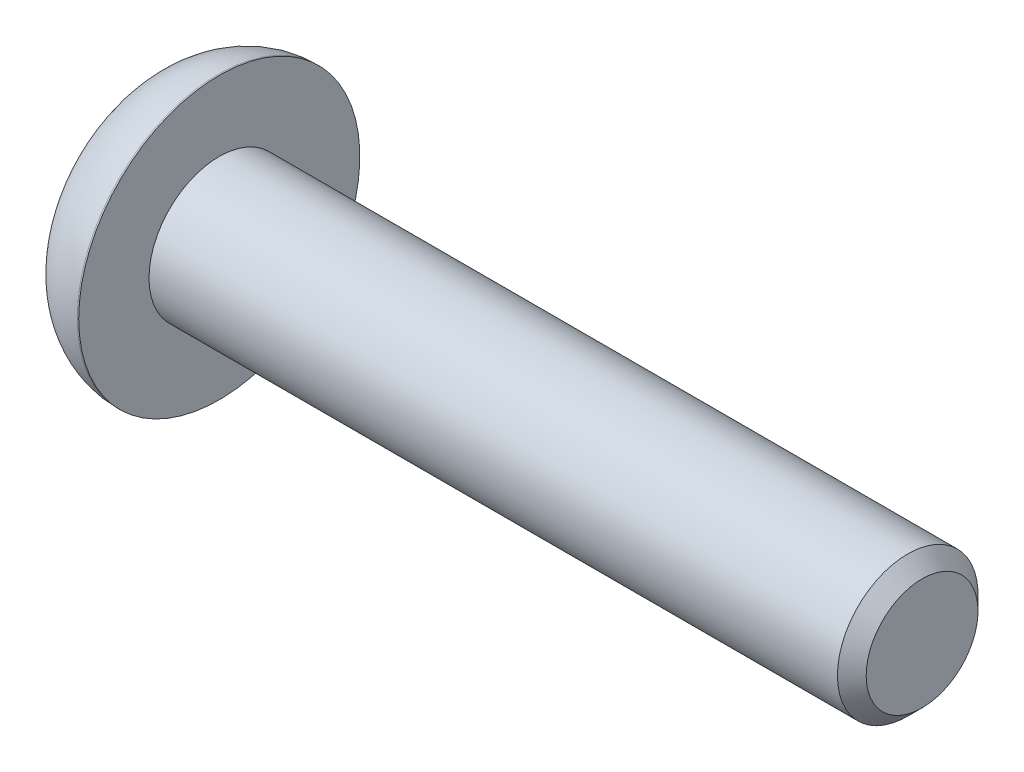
ISO-10303-21;
HEADER;
FILE_DESCRIPTION(('STEP AP214'),'2;1');
FILE_NAME('part.step','',(''),(''),'','','');
FILE_SCHEMA(('AUTOMOTIVE_DESIGN { 1 0 10303 214 1 1 1 1 }'));
ENDSEC;
DATA;
#1=APPLICATION_CONTEXT('core data for automotive mechanical design processes');
#2=APPLICATION_PROTOCOL_DEFINITION('international standard','automotive_design',2000,#1);
#3=PRODUCT_CONTEXT('',#1,'mechanical');
#4=PRODUCT('Part','Part','',(#3));
#5=PRODUCT_RELATED_PRODUCT_CATEGORY('part','',(#4));
#6=PRODUCT_DEFINITION_FORMATION('','',#4);
#7=PRODUCT_DEFINITION_CONTEXT('part definition',#1,'design');
#8=PRODUCT_DEFINITION('design','',#6,#7);
#9=PRODUCT_DEFINITION_SHAPE('','',#8);
#10=(LENGTH_UNIT() NAMED_UNIT(*) SI_UNIT(.MILLI.,.METRE.));
#11=(NAMED_UNIT(*) PLANE_ANGLE_UNIT() SI_UNIT($,.RADIAN.));
#12=(NAMED_UNIT(*) SI_UNIT($,.STERADIAN.) SOLID_ANGLE_UNIT());
#13=UNCERTAINTY_MEASURE_WITH_UNIT(LENGTH_MEASURE(1.E-05),#10,'distance_accuracy_value','');
#14=(GEOMETRIC_REPRESENTATION_CONTEXT(3) GLOBAL_UNCERTAINTY_ASSIGNED_CONTEXT((#13)) GLOBAL_UNIT_ASSIGNED_CONTEXT((#10,
#11,#12)) REPRESENTATION_CONTEXT('',''));
#15=CARTESIAN_POINT('',(0.,0.,0.));
#16=DIRECTION('',(0.,0.,1.));
#17=DIRECTION('',(1.,0.,0.));
#18=AXIS2_PLACEMENT_3D('',#15,#16,#17);
#19=CARTESIAN_POINT('',(2.14499999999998,0.,0.));
#20=DIRECTION('',(1.,0.,0.));
#21=DIRECTION('',(0.,0.,-1.));
#22=AXIS2_PLACEMENT_3D('',#19,#20,#21);
#23=PLANE('',#22);
#24=DIRECTION('',(0.,1.,0.));
#25=VECTOR('',#24,1.);
#26=CARTESIAN_POINT('',(2.14499999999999,0.,1.99999999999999));
#27=LINE('',#26,#25);
#28=CARTESIAN_POINT('',(2.14500000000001,1.15470053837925,2.));
#29=VERTEX_POINT('',#28);
#30=CARTESIAN_POINT('',(2.14499999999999,0.,1.99999999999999));
#31=VERTEX_POINT('',#30);
#32=EDGE_CURVE('E90',#29,#31,#27,.F.);
#33=ORIENTED_EDGE('',*,*,#32,.F.);
#34=DIRECTION('',(0.,-0.5,0.866025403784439));
#35=VECTOR('',#34,1.);
#36=CARTESIAN_POINT('',(2.14500000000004,1.73205080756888,0.999999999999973));
#37=LINE('',#36,#35);
#38=CARTESIAN_POINT('',(2.14500000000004,1.73205080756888,0.999999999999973));
#39=VERTEX_POINT('',#38);
#40=EDGE_CURVE('E104',#39,#29,#37,.T.);
#41=ORIENTED_EDGE('',*,*,#40,.F.);
#42=CARTESIAN_POINT('',(2.14499999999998,0.,0.));
#43=DIRECTION('',(-1.,0.,0.));
#44=DIRECTION('',(0.,0.,1.));
#45=AXIS2_PLACEMENT_3D('',#42,#43,#44);
#46=CIRCLE('',#45,2.);
#47=EDGE_CURVE('E112',#39,#31,#46,.F.);
#48=ORIENTED_EDGE('',*,*,#47,.T.);
#49=EDGE_LOOP('',(#33,#41,#48));
#50=FACE_BOUND('',#49,.T.);
#51=ADVANCED_FACE('F17',(#50),#23,.F.);
#52=CARTESIAN_POINT('',(2.14499999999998,0.,0.));
#53=DIRECTION('',(1.,0.,0.));
#54=DIRECTION('',(0.,0.,-1.));
#55=AXIS2_PLACEMENT_3D('',#52,#53,#54);
#56=PLANE('',#55);
#57=DIRECTION('',(0.,1.,0.));
#58=VECTOR('',#57,1.);
#59=CARTESIAN_POINT('',(2.14499999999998,0.,-2.));
#60=LINE('',#59,#58);
#61=CARTESIAN_POINT('',(2.14499999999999,-1.15470053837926,-1.99999999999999));
#62=VERTEX_POINT('',#61);
#63=CARTESIAN_POINT('',(2.14499999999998,0.,-2.));
#64=VERTEX_POINT('',#63);
#65=EDGE_CURVE('E153',#62,#64,#60,.T.);
#66=ORIENTED_EDGE('',*,*,#65,.F.);
#67=DIRECTION('',(0.,0.5,-0.866025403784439));
#68=VECTOR('',#67,1.);
#69=CARTESIAN_POINT('',(2.14500000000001,-1.73205080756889,-0.999999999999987));
#70=LINE('',#69,#68);
#71=CARTESIAN_POINT('',(2.14500000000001,-1.73205080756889,-0.999999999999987));
#72=VERTEX_POINT('',#71);
#73=EDGE_CURVE('E103',#72,#62,#70,.T.);
#74=ORIENTED_EDGE('',*,*,#73,.F.);
#75=CARTESIAN_POINT('',(2.14499999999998,0.,0.));
#76=DIRECTION('',(-1.,0.,0.));
#77=DIRECTION('',(0.,0.,1.));
#78=AXIS2_PLACEMENT_3D('',#75,#76,#77);
#79=CIRCLE('',#78,2.);
#80=EDGE_CURVE('E197',#72,#64,#79,.F.);
#81=ORIENTED_EDGE('',*,*,#80,.T.);
#82=EDGE_LOOP('',(#66,#74,#81));
#83=FACE_BOUND('',#82,.T.);
#84=ADVANCED_FACE('F361',(#83),#56,.F.);
#85=CARTESIAN_POINT('',(2.14499999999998,0.,0.));
#86=DIRECTION('',(1.,0.,0.));
#87=DIRECTION('',(0.,0.,-1.));
#88=AXIS2_PLACEMENT_3D('',#85,#86,#87);
#89=PLANE('',#88);
#90=DIRECTION('',(0.,0.5,0.866025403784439));
#91=VECTOR('',#90,1.);
#92=CARTESIAN_POINT('',(2.14499999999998,1.15470053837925,-2.));
#93=LINE('',#92,#91);
#94=CARTESIAN_POINT('',(2.14499999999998,1.15470053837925,-2.));
#95=VERTEX_POINT('',#94);
#96=CARTESIAN_POINT('',(2.14500000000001,1.73205080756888,-1.00000000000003));
#97=VERTEX_POINT('',#96);
#98=EDGE_CURVE('E147',#95,#97,#93,.T.);
#99=ORIENTED_EDGE('',*,*,#98,.F.);
#100=DIRECTION('',(0.,1.,0.));
#101=VECTOR('',#100,1.);
#102=CARTESIAN_POINT('',(2.14499999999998,0.,-2.));
#103=LINE('',#102,#101);
#104=EDGE_CURVE('E149',#64,#95,#103,.T.);
#105=ORIENTED_EDGE('',*,*,#104,.F.);
#106=CARTESIAN_POINT('',(2.14499999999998,0.,0.));
#107=DIRECTION('',(-1.,0.,0.));
#108=DIRECTION('',(0.,0.,1.));
#109=AXIS2_PLACEMENT_3D('',#106,#107,#108);
#110=CIRCLE('',#109,2.);
#111=EDGE_CURVE('E192',#64,#97,#110,.F.);
#112=ORIENTED_EDGE('',*,*,#111,.T.);
#113=EDGE_LOOP('',(#99,#105,#112));
#114=FACE_BOUND('',#113,.T.);
#115=ADVANCED_FACE('F346',(#114),#89,.F.);
#116=CARTESIAN_POINT('',(1.07264973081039,0.,0.));
#117=DIRECTION('',(-1.,0.,0.));
#118=DIRECTION('',(0.,0.,1.));
#119=AXIS2_PLACEMENT_3D('',#116,#117,#118);
#120=CYLINDRICAL_SURFACE('',#119,2.);
#121=CARTESIAN_POINT('',(2.14499999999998,0.,0.));
#122=DIRECTION('',(-1.,0.,0.));
#123=DIRECTION('',(0.,0.,1.));
#124=AXIS2_PLACEMENT_3D('',#121,#122,#123);
#125=CIRCLE('',#124,2.);
#126=CARTESIAN_POINT('',(2.14499999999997,-1.73205080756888,1.));
#127=VERTEX_POINT('',#126);
#128=CARTESIAN_POINT('',(2.14514973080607,-1.99999999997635,0.));
#129=VERTEX_POINT('',#128);
#130=EDGE_CURVE('E114',#127,#129,#125,.F.);
#131=ORIENTED_EDGE('',*,*,#130,.F.);
#132=CARTESIAN_POINT('',(2.14499999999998,0.,0.));
#133=DIRECTION('',(-1.,0.,0.));
#134=DIRECTION('',(0.,0.,1.));
#135=AXIS2_PLACEMENT_3D('',#132,#133,#134);
#136=CIRCLE('',#135,2.);
#137=EDGE_CURVE('E109',#127,#31,#136,.T.);
#138=ORIENTED_EDGE('',*,*,#137,.T.);
#139=ORIENTED_EDGE('',*,*,#47,.F.);
#140=CARTESIAN_POINT('',(2.14499999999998,0.,0.));
#141=DIRECTION('',(-1.,0.,0.));
#142=DIRECTION('',(0.,0.,1.));
#143=AXIS2_PLACEMENT_3D('',#140,#141,#142);
#144=CIRCLE('',#143,2.);
#145=CARTESIAN_POINT('',(2.14514973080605,1.99999999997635,0.));
#146=VERTEX_POINT('',#145);
#147=EDGE_CURVE('E120',#146,#39,#144,.F.);
#148=ORIENTED_EDGE('',*,*,#147,.F.);
#149=CARTESIAN_POINT('',(2.14529946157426,0.,0.));
#150=DIRECTION('',(-1.,0.,0.));
#151=DIRECTION('',(0.,1.,0.));
#152=AXIS2_PLACEMENT_3D('',#149,#150,#151);
#153=CIRCLE('',#152,2.00000000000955);
#154=EDGE_CURVE('E144',#146,#129,#153,.F.);
#155=ORIENTED_EDGE('',*,*,#154,.T.);
#156=EDGE_LOOP('',(#131,#138,#139,#148,#155));
#157=FACE_BOUND('',#156,.T.);
#158=ADVANCED_FACE('F110',(#157),#120,.F.);
#159=CARTESIAN_POINT('',(1.07264973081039,0.,0.));
#160=DIRECTION('',(-1.,0.,0.));
#161=DIRECTION('',(0.,0.,1.));
#162=AXIS2_PLACEMENT_3D('',#159,#160,#161);
#163=CYLINDRICAL_SURFACE('',#162,2.);
#164=ORIENTED_EDGE('',*,*,#111,.F.);
#165=ORIENTED_EDGE('',*,*,#80,.F.);
#166=CARTESIAN_POINT('',(2.14499999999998,0.,0.));
#167=DIRECTION('',(-1.,0.,0.));
#168=DIRECTION('',(0.,0.,1.));
#169=AXIS2_PLACEMENT_3D('',#166,#167,#168);
#170=CIRCLE('',#169,2.);
#171=EDGE_CURVE('E200',#129,#72,#170,.F.);
#172=ORIENTED_EDGE('',*,*,#171,.F.);
#173=CARTESIAN_POINT('',(2.14529946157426,0.,0.));
#174=DIRECTION('',(-1.,0.,0.));
#175=DIRECTION('',(0.,1.,0.));
#176=AXIS2_PLACEMENT_3D('',#173,#174,#175);
#177=CIRCLE('',#176,2.00000000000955);
#178=EDGE_CURVE('E118',#129,#146,#177,.F.);
#179=ORIENTED_EDGE('',*,*,#178,.T.);
#180=CARTESIAN_POINT('',(2.14499999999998,0.,0.));
#181=DIRECTION('',(-1.,0.,0.));
#182=DIRECTION('',(0.,0.,1.));
#183=AXIS2_PLACEMENT_3D('',#180,#181,#182);
#184=CIRCLE('',#183,2.);
#185=EDGE_CURVE('E146',#97,#146,#184,.F.);
#186=ORIENTED_EDGE('',*,*,#185,.F.);
#187=EDGE_LOOP('',(#164,#165,#172,#179,#186));
#188=FACE_BOUND('',#187,.T.);
#189=ADVANCED_FACE('F351',(#188),#163,.F.);
#190=CARTESIAN_POINT('',(2.14529946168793,0.,0.));
#191=DIRECTION('',(-1.,0.,0.));
#192=DIRECTION('',(0.,0.,1.));
#193=AXIS2_PLACEMENT_3D('',#190,#191,#192);
#194=CONICAL_SURFACE('',#193,1.99999999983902,1.04719755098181);
#195=CARTESIAN_POINT('',(3.29999999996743,3.97903932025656E-10,0.));
#196=VERTEX_POINT('',#195);
#197=VERTEX_LOOP('',#196);
#198=FACE_BOUND('',#197,.T.);
#199=ORIENTED_EDGE('',*,*,#154,.F.);
#200=ORIENTED_EDGE('',*,*,#178,.F.);
#201=EDGE_LOOP('',(#199,#200));
#202=FACE_BOUND('',#201,.T.);
#203=ADVANCED_FACE('F355',(#198,#202),#194,.F.);
#204=CARTESIAN_POINT('',(2.14499999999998,0.,0.));
#205=DIRECTION('',(1.,0.,0.));
#206=DIRECTION('',(0.,0.,-1.));
#207=AXIS2_PLACEMENT_3D('',#204,#205,#206);
#208=PLANE('',#207);
#209=DIRECTION('',(0.,-0.5,-0.866025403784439));
#210=VECTOR('',#209,1.);
#211=CARTESIAN_POINT('',(2.14499999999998,-2.3094010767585,0.));
#212=LINE('',#211,#210);
#213=CARTESIAN_POINT('',(2.145,-1.15470053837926,2.));
#214=VERTEX_POINT('',#213);
#215=EDGE_CURVE('E123',#127,#214,#212,.F.);
#216=ORIENTED_EDGE('',*,*,#215,.T.);
#217=DIRECTION('',(0.,1.,0.));
#218=VECTOR('',#217,1.);
#219=CARTESIAN_POINT('',(2.145,-1.15470053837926,2.));
#220=LINE('',#219,#218);
#221=EDGE_CURVE('E95',#214,#31,#220,.T.);
#222=ORIENTED_EDGE('',*,*,#221,.T.);
#223=ORIENTED_EDGE('',*,*,#137,.F.);
#224=EDGE_LOOP('',(#216,#222,#223));
#225=FACE_BOUND('',#224,.T.);
#226=ADVANCED_FACE('F122',(#225),#208,.F.);
#227=CARTESIAN_POINT('',(2.14499999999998,0.,0.));
#228=DIRECTION('',(1.,0.,0.));
#229=DIRECTION('',(0.,0.,-1.));
#230=AXIS2_PLACEMENT_3D('',#227,#228,#229);
#231=PLANE('',#230);
#232=DIRECTION('',(0.,0.5,-0.866025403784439));
#233=VECTOR('',#232,1.);
#234=CARTESIAN_POINT('',(2.14499999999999,-1.15470053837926,-1.99999999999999));
#235=LINE('',#234,#233);
#236=CARTESIAN_POINT('',(2.14499999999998,-2.3094010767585,0.));
#237=VERTEX_POINT('',#236);
#238=EDGE_CURVE('E135',#72,#237,#235,.F.);
#239=ORIENTED_EDGE('',*,*,#238,.T.);
#240=DIRECTION('',(0.,-0.5,-0.866025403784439));
#241=VECTOR('',#240,1.);
#242=CARTESIAN_POINT('',(2.14499999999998,-2.3094010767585,0.));
#243=LINE('',#242,#241);
#244=EDGE_CURVE('E124',#237,#127,#243,.F.);
#245=ORIENTED_EDGE('',*,*,#244,.T.);
#246=ORIENTED_EDGE('',*,*,#130,.T.);
#247=ORIENTED_EDGE('',*,*,#171,.T.);
#248=EDGE_LOOP('',(#239,#245,#246,#247));
#249=FACE_BOUND('',#248,.T.);
#250=ADVANCED_FACE('F357',(#249),#231,.F.);
#251=CARTESIAN_POINT('',(2.14499999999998,0.,0.));
#252=DIRECTION('',(1.,0.,0.));
#253=DIRECTION('',(0.,0.,-1.));
#254=AXIS2_PLACEMENT_3D('',#251,#252,#253);
#255=PLANE('',#254);
#256=DIRECTION('',(0.,-0.5,0.866025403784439));
#257=VECTOR('',#256,1.);
#258=CARTESIAN_POINT('',(2.14500000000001,1.15470053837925,2.));
#259=LINE('',#258,#257);
#260=CARTESIAN_POINT('',(2.14499999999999,2.3094010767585,0.));
#261=VERTEX_POINT('',#260);
#262=EDGE_CURVE('E180',#39,#261,#259,.F.);
#263=ORIENTED_EDGE('',*,*,#262,.T.);
#264=DIRECTION('',(0.,0.5,0.866025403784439));
#265=VECTOR('',#264,1.);
#266=CARTESIAN_POINT('',(2.14499999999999,2.3094010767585,0.));
#267=LINE('',#266,#265);
#268=EDGE_CURVE('E170',#261,#97,#267,.F.);
#269=ORIENTED_EDGE('',*,*,#268,.T.);
#270=ORIENTED_EDGE('',*,*,#185,.T.);
#271=ORIENTED_EDGE('',*,*,#147,.T.);
#272=EDGE_LOOP('',(#263,#269,#270,#271));
#273=FACE_BOUND('',#272,.T.);
#274=ADVANCED_FACE('F338',(#273),#255,.F.);
#275=CARTESIAN_POINT('',(0.,-1.15470053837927,2.));
#276=DIRECTION('',(0.,0.,1.));
#277=DIRECTION('',(1.,0.,0.));
#278=AXIS2_PLACEMENT_3D('',#275,#276,#277);
#279=PLANE('',#278);
#280=DIRECTION('',(1.,0.,0.));
#281=VECTOR('',#280,1.);
#282=CARTESIAN_POINT('',(0.,1.15470053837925,2.));
#283=LINE('',#282,#281);
#284=CARTESIAN_POINT('',(0.,1.15470053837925,2.));
#285=VERTEX_POINT('',#284);
#286=EDGE_CURVE('E99',#285,#29,#283,.T.);
#287=ORIENTED_EDGE('',*,*,#286,.T.);
#288=ORIENTED_EDGE('',*,*,#32,.T.);
#289=ORIENTED_EDGE('',*,*,#221,.F.);
#290=DIRECTION('',(1.,0.,0.));
#291=VECTOR('',#290,1.);
#292=CARTESIAN_POINT('',(0.,-1.15470053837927,2.));
#293=LINE('',#292,#291);
#294=CARTESIAN_POINT('',(0.,-1.15470053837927,2.));
#295=VERTEX_POINT('',#294);
#296=EDGE_CURVE('E133',#214,#295,#293,.F.);
#297=ORIENTED_EDGE('',*,*,#296,.T.);
#298=DIRECTION('',(0.,1.,0.));
#299=VECTOR('',#298,1.);
#300=CARTESIAN_POINT('',(0.,1.38,2.));
#301=LINE('',#300,#299);
#302=EDGE_CURVE('E281',#285,#295,#301,.F.);
#303=ORIENTED_EDGE('',*,*,#302,.F.);
#304=EDGE_LOOP('',(#287,#288,#289,#297,#303));
#305=FACE_BOUND('',#304,.T.);
#306=ADVANCED_FACE('F92',(#305),#279,.F.);
#307=CARTESIAN_POINT('',(0.,-2.3094010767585,0.));
#308=DIRECTION('',(0.,-0.866025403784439,0.5));
#309=DIRECTION('',(0.,-0.5,-0.866025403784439));
#310=AXIS2_PLACEMENT_3D('',#307,#308,#309);
#311=PLANE('',#310);
#312=ORIENTED_EDGE('',*,*,#296,.F.);
#313=ORIENTED_EDGE('',*,*,#215,.F.);
#314=ORIENTED_EDGE('',*,*,#244,.F.);
#315=DIRECTION('',(1.,0.,0.));
#316=VECTOR('',#315,1.);
#317=CARTESIAN_POINT('',(0.,-2.3094010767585,0.));
#318=LINE('',#317,#316);
#319=CARTESIAN_POINT('',(0.,-2.3094010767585,0.));
#320=VERTEX_POINT('',#319);
#321=EDGE_CURVE('E176',#237,#320,#318,.F.);
#322=ORIENTED_EDGE('',*,*,#321,.T.);
#323=DIRECTION('',(0.,-0.5,-0.866025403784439));
#324=VECTOR('',#323,1.);
#325=CARTESIAN_POINT('',(0.,-1.15470053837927,2.));
#326=LINE('',#325,#324);
#327=EDGE_CURVE('E278',#295,#320,#326,.T.);
#328=ORIENTED_EDGE('',*,*,#327,.F.);
#329=EDGE_LOOP('',(#312,#313,#314,#322,#328));
#330=FACE_BOUND('',#329,.T.);
#331=ADVANCED_FACE('F318',(#330),#311,.F.);
#332=CARTESIAN_POINT('',(0.,-1.15470053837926,-2.));
#333=DIRECTION('',(0.,-0.866025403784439,-0.5));
#334=DIRECTION('',(0.,0.5,-0.866025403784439));
#335=AXIS2_PLACEMENT_3D('',#332,#333,#334);
#336=PLANE('',#335);
#337=ORIENTED_EDGE('',*,*,#321,.F.);
#338=ORIENTED_EDGE('',*,*,#238,.F.);
#339=ORIENTED_EDGE('',*,*,#73,.T.);
#340=DIRECTION('',(-1.,0.,0.));
#341=VECTOR('',#340,1.);
#342=CARTESIAN_POINT('',(0.,-1.15470053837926,-2.));
#343=LINE('',#342,#341);
#344=CARTESIAN_POINT('',(0.,-1.15470053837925,-1.99999999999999));
#345=VERTEX_POINT('',#344);
#346=EDGE_CURVE('E173',#62,#345,#343,.T.);
#347=ORIENTED_EDGE('',*,*,#346,.T.);
#348=DIRECTION('',(0.,0.5,-0.866025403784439));
#349=VECTOR('',#348,1.);
#350=CARTESIAN_POINT('',(0.,-2.3094010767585,0.));
#351=LINE('',#350,#349);
#352=EDGE_CURVE('E275',#320,#345,#351,.T.);
#353=ORIENTED_EDGE('',*,*,#352,.F.);
#354=EDGE_LOOP('',(#337,#338,#339,#347,#353));
#355=FACE_BOUND('',#354,.T.);
#356=ADVANCED_FACE('F324',(#355),#336,.F.);
#357=CARTESIAN_POINT('',(0.,1.15470053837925,-2.));
#358=DIRECTION('',(0.,0.,-1.));
#359=DIRECTION('',(-1.,0.,0.));
#360=AXIS2_PLACEMENT_3D('',#357,#358,#359);
#361=PLANE('',#360);
#362=ORIENTED_EDGE('',*,*,#346,.F.);
#363=ORIENTED_EDGE('',*,*,#65,.T.);
#364=ORIENTED_EDGE('',*,*,#104,.T.);
#365=DIRECTION('',(1.,0.,0.));
#366=VECTOR('',#365,1.);
#367=CARTESIAN_POINT('',(0.,1.15470053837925,-2.));
#368=LINE('',#367,#366);
#369=CARTESIAN_POINT('',(0.,1.15470053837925,-2.));
#370=VERTEX_POINT('',#369);
#371=EDGE_CURVE('E167',#95,#370,#368,.F.);
#372=ORIENTED_EDGE('',*,*,#371,.T.);
#373=DIRECTION('',(0.,1.,0.));
#374=VECTOR('',#373,1.);
#375=CARTESIAN_POINT('',(0.,1.37999999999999,-2.));
#376=LINE('',#375,#374);
#377=EDGE_CURVE('E272',#345,#370,#376,.T.);
#378=ORIENTED_EDGE('',*,*,#377,.F.);
#379=EDGE_LOOP('',(#362,#363,#364,#372,#378));
#380=FACE_BOUND('',#379,.T.);
#381=ADVANCED_FACE('F363',(#380),#361,.F.);
#382=CARTESIAN_POINT('',(0.,2.3094010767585,0.));
#383=DIRECTION('',(0.,0.866025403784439,-0.5));
#384=DIRECTION('',(0.,0.5,0.866025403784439));
#385=AXIS2_PLACEMENT_3D('',#382,#383,#384);
#386=PLANE('',#385);
#387=ORIENTED_EDGE('',*,*,#371,.F.);
#388=ORIENTED_EDGE('',*,*,#98,.T.);
#389=ORIENTED_EDGE('',*,*,#268,.F.);
#390=DIRECTION('',(1.,0.,0.));
#391=VECTOR('',#390,1.);
#392=CARTESIAN_POINT('',(0.,2.3094010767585,0.));
#393=LINE('',#392,#391);
#394=CARTESIAN_POINT('',(0.,2.3094010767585,0.));
#395=VERTEX_POINT('',#394);
#396=EDGE_CURVE('E284',#261,#395,#393,.F.);
#397=ORIENTED_EDGE('',*,*,#396,.T.);
#398=DIRECTION('',(0.,0.5,0.866025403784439));
#399=VECTOR('',#398,1.);
#400=CARTESIAN_POINT('',(0.,1.15470053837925,-2.));
#401=LINE('',#400,#399);
#402=EDGE_CURVE('E269',#370,#395,#401,.T.);
#403=ORIENTED_EDGE('',*,*,#402,.F.);
#404=EDGE_LOOP('',(#387,#388,#389,#397,#403));
#405=FACE_BOUND('',#404,.T.);
#406=ADVANCED_FACE('F341',(#405),#386,.F.);
#407=CARTESIAN_POINT('',(0.,1.15470053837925,2.));
#408=DIRECTION('',(0.,0.866025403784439,0.5));
#409=DIRECTION('',(0.,-0.5,0.866025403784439));
#410=AXIS2_PLACEMENT_3D('',#407,#408,#409);
#411=PLANE('',#410);
#412=ORIENTED_EDGE('',*,*,#396,.F.);
#413=ORIENTED_EDGE('',*,*,#262,.F.);
#414=ORIENTED_EDGE('',*,*,#40,.T.);
#415=ORIENTED_EDGE('',*,*,#286,.F.);
#416=DIRECTION('',(0.,-0.5,0.866025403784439));
#417=VECTOR('',#416,1.);
#418=CARTESIAN_POINT('',(0.,2.3094010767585,0.));
#419=LINE('',#418,#417);
#420=EDGE_CURVE('E261',#395,#285,#419,.T.);
#421=ORIENTED_EDGE('',*,*,#420,.F.);
#422=EDGE_LOOP('',(#412,#413,#414,#415,#421));
#423=FACE_BOUND('',#422,.T.);
#424=ADVANCED_FACE('F333',(#423),#411,.F.);
#425=CARTESIAN_POINT('',(0.,1.37999999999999,0.));
#426=DIRECTION('',(-1.,0.,0.));
#427=DIRECTION('',(0.,0.,1.));
#428=AXIS2_PLACEMENT_3D('',#425,#426,#427);
#429=PLANE('',#428);
#430=CARTESIAN_POINT('',(0.,0.,0.));
#431=DIRECTION('',(1.,0.,0.));
#432=DIRECTION('',(0.,0.,1.));
#433=AXIS2_PLACEMENT_3D('',#430,#431,#432);
#434=CIRCLE('',#433,2.76);
#435=CARTESIAN_POINT('',(0.,0.,2.76));
#436=VERTEX_POINT('',#435);
#437=CARTESIAN_POINT('',(0.,0.,-2.75999999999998));
#438=VERTEX_POINT('',#437);
#439=EDGE_CURVE('E247',#436,#438,#434,.T.);
#440=ORIENTED_EDGE('',*,*,#439,.F.);
#441=CARTESIAN_POINT('',(0.,0.,0.));
#442=DIRECTION('',(1.,0.,0.));
#443=DIRECTION('',(0.,1.,0.));
#444=AXIS2_PLACEMENT_3D('',#441,#442,#443);
#445=CIRCLE('',#444,2.76);
#446=CARTESIAN_POINT('',(0.,2.75999999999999,0.));
#447=VERTEX_POINT('',#446);
#448=EDGE_CURVE('E257',#447,#436,#445,.T.);
#449=ORIENTED_EDGE('',*,*,#448,.F.);
#450=CARTESIAN_POINT('',(0.,0.,0.));
#451=DIRECTION('',(1.,0.,0.));
#452=DIRECTION('',(0.,0.,-1.));
#453=AXIS2_PLACEMENT_3D('',#450,#451,#452);
#454=CIRCLE('',#453,2.76);
#455=EDGE_CURVE('E37',#438,#447,#454,.T.);
#456=ORIENTED_EDGE('',*,*,#455,.F.);
#457=EDGE_LOOP('',(#440,#449,#456));
#458=FACE_BOUND('',#457,.T.);
#459=ORIENTED_EDGE('',*,*,#402,.T.);
#460=ORIENTED_EDGE('',*,*,#420,.T.);
#461=ORIENTED_EDGE('',*,*,#302,.T.);
#462=ORIENTED_EDGE('',*,*,#327,.T.);
#463=ORIENTED_EDGE('',*,*,#352,.T.);
#464=ORIENTED_EDGE('',*,*,#377,.T.);
#465=EDGE_LOOP('',(#459,#460,#461,#462,#463,#464));
#466=FACE_BOUND('',#465,.T.);
#467=ADVANCED_FACE('F227',(#458,#466),#429,.T.);
#468=CARTESIAN_POINT('',(3.23999999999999,0.,2.75999999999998));
#469=DIRECTION('',(0.,1.,0.));
#470=DIRECTION('',(0.,0.,1.));
#471=AXIS2_PLACEMENT_3D('',#468,#469,#470);
#472=CIRCLE('',#471,3.24);
#473=TRIMMED_CURVE('',#472,(PARAMETER_VALUE(-2.59030705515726)),
(PARAMETER_VALUE(2.59030705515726)),.T.,.PARAMETER.);
#474=CARTESIAN_POINT('',(3.23999999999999,0.,0.));
#475=DIRECTION('',(-1.,0.,0.));
#476=AXIS1_PLACEMENT('',#474,#475);
#477=SURFACE_OF_REVOLUTION('',#473,#476);
#478=ORIENTED_EDGE('',*,*,#448,.T.);
#479=ORIENTED_EDGE('',*,*,#439,.T.);
#480=ORIENTED_EDGE('',*,*,#455,.T.);
#481=EDGE_LOOP('',(#478,#479,#480));
#482=FACE_BOUND('',#481,.T.);
#483=CARTESIAN_POINT('',(3.23999999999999,0.,0.));
#484=DIRECTION('',(-1.,0.,0.));
#485=DIRECTION('',(0.,0.,1.));
#486=AXIS2_PLACEMENT_3D('',#483,#484,#485);
#487=CIRCLE('',#486,6.);
#488=CARTESIAN_POINT('',(3.23999999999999,0.,6.));
#489=VERTEX_POINT('',#488);
#490=EDGE_CURVE('E188',#489,#489,#487,.F.);
#491=ORIENTED_EDGE('',*,*,#490,.F.);
#492=EDGE_LOOP('',(#491));
#493=FACE_BOUND('',#492,.T.);
#494=ADVANCED_FACE('F215',(#482,#493),#477,.F.);
#495=CARTESIAN_POINT('',(33.3,1.19325000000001,0.));
#496=DIRECTION('',(1.,0.,0.));
#497=DIRECTION('',(0.,0.,-1.));
#498=AXIS2_PLACEMENT_3D('',#495,#496,#497);
#499=PLANE('',#498);
#500=CARTESIAN_POINT('',(33.2999999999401,0.,0.));
#501=DIRECTION('',(-1.,0.,0.));
#502=DIRECTION('',(0.,0.,1.));
#503=AXIS2_PLACEMENT_3D('',#500,#501,#502);
#504=CIRCLE('',#503,2.38650000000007);
#505=CARTESIAN_POINT('',(33.2999999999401,0.,2.38650000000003));
#506=VERTEX_POINT('',#505);
#507=EDGE_CURVE('E186',#506,#506,#504,.T.);
#508=ORIENTED_EDGE('',*,*,#507,.F.);
#509=EDGE_LOOP('',(#508));
#510=FACE_BOUND('',#509,.T.);
#511=ADVANCED_FACE('F226',(#510),#499,.T.);
#512=CARTESIAN_POINT('',(3.26999999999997,0.,0.));
#513=DIRECTION('',(-1.,0.,0.));
#514=DIRECTION('',(0.,0.,1.));
#515=AXIS2_PLACEMENT_3D('',#512,#513,#514);
#516=CYLINDRICAL_SURFACE('',#515,6.);
#517=CARTESIAN_POINT('',(3.30000000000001,0.,0.));
#518=DIRECTION('',(-1.,0.,0.));
#519=DIRECTION('',(0.,0.,1.));
#520=AXIS2_PLACEMENT_3D('',#517,#518,#519);
#521=CIRCLE('',#520,6.);
#522=CARTESIAN_POINT('',(3.30000000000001,0.,6.));
#523=VERTEX_POINT('',#522);
#524=EDGE_CURVE('E183',#523,#523,#521,.F.);
#525=CARTESIAN_POINT('',(3.23999999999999,0.,6.));
#526=CARTESIAN_POINT('',(3.24062499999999,0.,6.));
#527=CARTESIAN_POINT('',(3.24124999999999,0.,6.));
#528=CARTESIAN_POINT('',(3.24249999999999,0.,6.));
#529=CARTESIAN_POINT('',(3.24312499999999,0.,6.));
#530=CARTESIAN_POINT('',(3.24437499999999,0.,6.));
#531=CARTESIAN_POINT('',(3.24499999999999,0.,6.));
#532=CARTESIAN_POINT('',(3.24625,0.,6.));
#533=CARTESIAN_POINT('',(3.246875,0.,6.));
#534=CARTESIAN_POINT('',(3.248125,0.,6.));
#535=CARTESIAN_POINT('',(3.24875,0.,6.));
#536=CARTESIAN_POINT('',(3.25,0.,6.));
#537=CARTESIAN_POINT('',(3.250625,0.,6.));
#538=CARTESIAN_POINT('',(3.251875,0.,6.));
#539=CARTESIAN_POINT('',(3.2525,0.,6.));
#540=CARTESIAN_POINT('',(3.25375,0.,6.));
#541=CARTESIAN_POINT('',(3.254375,0.,6.));
#542=CARTESIAN_POINT('',(3.255625,0.,6.));
#543=CARTESIAN_POINT('',(3.25625,0.,6.));
#544=CARTESIAN_POINT('',(3.2575,0.,6.));
#545=CARTESIAN_POINT('',(3.258125,0.,6.));
#546=CARTESIAN_POINT('',(3.259375,0.,6.));
#547=CARTESIAN_POINT('',(3.26,0.,6.));
#548=CARTESIAN_POINT('',(3.26125,0.,6.));
#549=CARTESIAN_POINT('',(3.261875,0.,6.));
#550=CARTESIAN_POINT('',(3.263125,0.,6.));
#551=CARTESIAN_POINT('',(3.26375,0.,6.));
#552=CARTESIAN_POINT('',(3.265,0.,6.));
#553=CARTESIAN_POINT('',(3.265625,0.,6.));
#554=CARTESIAN_POINT('',(3.266875,0.,6.));
#555=CARTESIAN_POINT('',(3.2675,0.,6.));
#556=CARTESIAN_POINT('',(3.26875,0.,6.));
#557=CARTESIAN_POINT('',(3.269375,0.,6.));
#558=CARTESIAN_POINT('',(3.270625,0.,6.));
#559=CARTESIAN_POINT('',(3.27125,0.,6.));
#560=CARTESIAN_POINT('',(3.2725,0.,6.));
#561=CARTESIAN_POINT('',(3.273125,0.,6.));
#562=CARTESIAN_POINT('',(3.274375,0.,6.));
#563=CARTESIAN_POINT('',(3.275,0.,6.));
#564=CARTESIAN_POINT('',(3.27625,0.,6.));
#565=CARTESIAN_POINT('',(3.276875,0.,6.));
#566=CARTESIAN_POINT('',(3.27812500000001,0.,6.));
#567=CARTESIAN_POINT('',(3.27875000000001,0.,6.));
#568=CARTESIAN_POINT('',(3.28000000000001,0.,6.));
#569=CARTESIAN_POINT('',(3.28062500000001,0.,6.));
#570=CARTESIAN_POINT('',(3.28187500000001,0.,6.));
#571=CARTESIAN_POINT('',(3.28250000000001,0.,6.));
#572=CARTESIAN_POINT('',(3.28375000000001,0.,6.));
#573=CARTESIAN_POINT('',(3.28437500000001,0.,6.));
#574=CARTESIAN_POINT('',(3.28562500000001,0.,6.));
#575=CARTESIAN_POINT('',(3.28625000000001,0.,6.));
#576=CARTESIAN_POINT('',(3.28750000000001,0.,6.));
#577=CARTESIAN_POINT('',(3.28812500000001,0.,6.));
#578=CARTESIAN_POINT('',(3.28937500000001,0.,6.));
#579=CARTESIAN_POINT('',(3.29000000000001,0.,6.));
#580=CARTESIAN_POINT('',(3.29125000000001,0.,6.));
#581=CARTESIAN_POINT('',(3.29187500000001,0.,6.));
#582=CARTESIAN_POINT('',(3.29312500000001,0.,6.));
#583=CARTESIAN_POINT('',(3.29375000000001,0.,6.));
#584=CARTESIAN_POINT('',(3.29500000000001,0.,6.));
#585=CARTESIAN_POINT('',(3.29562500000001,0.,6.));
#586=CARTESIAN_POINT('',(3.29687500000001,0.,6.));
#587=CARTESIAN_POINT('',(3.29750000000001,0.,6.));
#588=CARTESIAN_POINT('',(3.29875000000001,0.,6.));
#589=CARTESIAN_POINT('',(3.29937500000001,0.,6.));
#590=CARTESIAN_POINT('',(3.30000000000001,0.,6.));
#591=B_SPLINE_CURVE_WITH_KNOTS('',3,(#525,#526,#527,#528,#529,#530,#531,#532,#533,#534,#535,
#536,#537,#538,#539,#540,#541,#542,#543,#544,#545,#546,#547,#548,#549,#550,#551,#552,#553,#554,
#555,#556,#557,#558,#559,#560,#561,#562,#563,#564,#565,#566,#567,#568,#569,#570,#571,#572,#573,
#574,#575,#576,#577,#578,#579,#580,#581,#582,#583,#584,#585,#586,#587,#588,#589,#590),
.UNSPECIFIED.,.F.,.F.,(4,2,2,2,2,2,2,2,2,2,2,2,2,2,2,2,2,2,2,2,2,2,2,2,2,2,2,2,2,2,2,2,4),(0.,
0.00187500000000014,0.00375000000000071,0.00562500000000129,0.0075000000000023,
0.00937500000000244,0.0112500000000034,0.0131250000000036,0.0150000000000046,0.0168750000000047,
0.0187500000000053,0.0206250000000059,0.0225000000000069,0.024375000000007,0.026250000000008,
0.0281250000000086,0.0300000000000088,0.0318750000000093,0.0337500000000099,0.0356250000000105,
0.0375000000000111,0.0393750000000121,0.0412500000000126,0.0431250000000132,0.0450000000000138,
0.0468750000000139,0.0487500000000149,0.0506250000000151,0.0525000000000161,0.0543750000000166,
0.0562500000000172,0.0581250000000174,0.0600000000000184),.UNSPECIFIED.);
#592=EDGE_CURVE('BSEAM392',#489,#523,#591,.T.);
#593=ORIENTED_EDGE('',*,*,#490,.T.);
#594=ORIENTED_EDGE('',*,*,#524,.F.);
#595=ORIENTED_EDGE('',*,*,#592,.T.);
#596=ORIENTED_EDGE('',*,*,#592,.F.);
#597=EDGE_LOOP('',(#593,#595,#594,#596));
#598=FACE_BOUND('',#597,.T.);
#599=ADVANCED_FACE('F392',(#598),#516,.T.);
#600=CARTESIAN_POINT('',(32.6865000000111,0.,0.));
#601=DIRECTION('',(-1.,0.,0.));
#602=DIRECTION('',(0.,0.,1.));
#603=AXIS2_PLACEMENT_3D('',#600,#601,#602);
#604=CONICAL_SURFACE('',#603,2.9999999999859,0.785398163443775);
#605=CARTESIAN_POINT('',(32.6865,0.,0.));
#606=DIRECTION('',(-1.,0.,0.));
#607=DIRECTION('',(0.,0.,1.));
#608=AXIS2_PLACEMENT_3D('',#605,#606,#607);
#609=CIRCLE('',#608,3.);
#610=CARTESIAN_POINT('',(32.6865,0.,2.99999999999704));
#611=VERTEX_POINT('',#610);
#612=EDGE_CURVE('E28',#611,#611,#609,.T.);
#613=CARTESIAN_POINT('',(33.2999999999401,0.,2.38650000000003));
#614=CARTESIAN_POINT('',(33.2936093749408,0.,2.392890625));
#615=CARTESIAN_POINT('',(33.2872187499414,0.,2.39928124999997));
#616=CARTESIAN_POINT('',(33.2744374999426,0.,2.4120624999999));
#617=CARTESIAN_POINT('',(33.2680468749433,0.,2.41845312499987));
#618=CARTESIAN_POINT('',(33.2552656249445,0.,2.43123437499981));
#619=CARTESIAN_POINT('',(33.2488749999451,0.,2.43762499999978));
#620=CARTESIAN_POINT('',(33.2360937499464,0.,2.45040624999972));
#621=CARTESIAN_POINT('',(33.229703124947,0.,2.45679687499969));
#622=CARTESIAN_POINT('',(33.2169218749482,0.,2.46957812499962));
#623=CARTESIAN_POINT('',(33.2105312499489,0.,2.47596874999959));
#624=CARTESIAN_POINT('',(33.1977499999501,0.,2.48874999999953));
#625=CARTESIAN_POINT('',(33.1913593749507,0.,2.4951406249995));
#626=CARTESIAN_POINT('',(33.178578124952,0.,2.50792187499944));
#627=CARTESIAN_POINT('',(33.1721874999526,0.,2.51431249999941));
#628=CARTESIAN_POINT('',(33.1594062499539,0.,2.52709374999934));
#629=CARTESIAN_POINT('',(33.1530156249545,0.,2.53348437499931));
#630=CARTESIAN_POINT('',(33.1402343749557,0.,2.54626562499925));
#631=CARTESIAN_POINT('',(33.1338437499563,0.,2.55265624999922));
#632=CARTESIAN_POINT('',(33.1210624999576,0.,2.56543749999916));
#633=CARTESIAN_POINT('',(33.1146718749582,0.,2.57182812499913));
#634=CARTESIAN_POINT('',(33.1018906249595,0.,2.58460937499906));
#635=CARTESIAN_POINT('',(33.0954999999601,0.,2.59099999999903));
#636=CARTESIAN_POINT('',(33.0827187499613,0.,2.60378124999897));
#637=CARTESIAN_POINT('',(33.076328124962,0.,2.61017187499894));
#638=CARTESIAN_POINT('',(33.0635468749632,0.,2.62295312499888));
#639=CARTESIAN_POINT('',(33.0571562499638,0.,2.62934374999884));
#640=CARTESIAN_POINT('',(33.0443749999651,0.,2.64212499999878));
#641=CARTESIAN_POINT('',(33.0379843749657,0.,2.64851562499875));
#642=CARTESIAN_POINT('',(33.0252031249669,0.,2.66129687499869));
#643=CARTESIAN_POINT('',(33.0188124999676,0.,2.66768749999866));
#644=CARTESIAN_POINT('',(33.0060312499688,0.,2.6804687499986));
#645=CARTESIAN_POINT('',(32.9996406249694,0.,2.68685937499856));
#646=CARTESIAN_POINT('',(32.9868593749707,0.,2.6996406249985));
#647=CARTESIAN_POINT('',(32.9804687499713,0.,2.70603124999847));
#648=CARTESIAN_POINT('',(32.9676874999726,0.,2.71881249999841));
#649=CARTESIAN_POINT('',(32.9612968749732,0.,2.72520312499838));
#650=CARTESIAN_POINT('',(32.9485156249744,0.,2.73798437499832));
#651=CARTESIAN_POINT('',(32.9421249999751,0.,2.74437499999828));
#652=CARTESIAN_POINT('',(32.9293437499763,0.,2.75715624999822));
#653=CARTESIAN_POINT('',(32.9229531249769,0.,2.76354687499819));
#654=CARTESIAN_POINT('',(32.9101718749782,0.,2.77632812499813));
#655=CARTESIAN_POINT('',(32.9037812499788,0.,2.7827187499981));
#656=CARTESIAN_POINT('',(32.89099999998,0.,2.79549999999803));
#657=CARTESIAN_POINT('',(32.8846093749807,0.,2.801890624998));
#658=CARTESIAN_POINT('',(32.8718281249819,0.,2.81467187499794));
#659=CARTESIAN_POINT('',(32.8654374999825,0.,2.82106249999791));
#660=CARTESIAN_POINT('',(32.8526562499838,0.,2.83384374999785));
#661=CARTESIAN_POINT('',(32.8462656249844,0.,2.84023437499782));
#662=CARTESIAN_POINT('',(32.8334843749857,0.,2.85301562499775));
#663=CARTESIAN_POINT('',(32.8270937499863,0.,2.85940624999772));
#664=CARTESIAN_POINT('',(32.8143124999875,0.,2.87218749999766));
#665=CARTESIAN_POINT('',(32.8079218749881,0.,2.87857812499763));
#666=CARTESIAN_POINT('',(32.7951406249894,0.,2.89135937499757));
#667=CARTESIAN_POINT('',(32.78874999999,0.,2.89774999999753));
#668=CARTESIAN_POINT('',(32.7759687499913,0.,2.91053124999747));
#669=CARTESIAN_POINT('',(32.7695781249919,0.,2.91692187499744));
#670=CARTESIAN_POINT('',(32.7567968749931,0.,2.92970312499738));
#671=CARTESIAN_POINT('',(32.7504062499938,0.,2.93609374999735));
#672=CARTESIAN_POINT('',(32.737624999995,0.,2.94887499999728));
#673=CARTESIAN_POINT('',(32.7312343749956,0.,2.95526562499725));
#674=CARTESIAN_POINT('',(32.7184531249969,0.,2.96804687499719));
#675=CARTESIAN_POINT('',(32.7120624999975,0.,2.97443749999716));
#676=CARTESIAN_POINT('',(32.6992812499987,0.,2.9872187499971));
#677=CARTESIAN_POINT('',(32.6928906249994,0.,2.99360937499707));
#678=CARTESIAN_POINT('',(32.6865,0.,2.99999999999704));
#679=B_SPLINE_CURVE_WITH_KNOTS('',3,(#613,#614,#615,#616,#617,#618,#619,#620,#621,#622,#623,
#624,#625,#626,#627,#628,#629,#630,#631,#632,#633,#634,#635,#636,#637,#638,#639,#640,#641,#642,
#643,#644,#645,#646,#647,#648,#649,#650,#651,#652,#653,#654,#655,#656,#657,#658,#659,#660,#661,
#662,#663,#664,#665,#666,#667,#668,#669,#670,#671,#672,#673,#674,#675,#676,#677,#678),
.UNSPECIFIED.,.F.,.F.,(4,2,2,2,2,2,2,2,2,2,2,2,2,2,2,2,2,2,2,2,2,2,2,2,2,2,2,2,2,2,2,2,4),(0.,
0.0271131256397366,0.0542262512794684,0.0813393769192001,0.108452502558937,0.135565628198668,
0.1626787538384,0.189791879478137,0.216905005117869,0.2440181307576,0.271131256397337,
0.298244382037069,0.325357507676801,0.352470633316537,0.379583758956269,0.406696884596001,
0.433810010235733,0.460923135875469,0.488036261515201,0.515149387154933,0.542262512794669,
0.569375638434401,0.596488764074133,0.623601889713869,0.650715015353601,0.677828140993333,
0.704941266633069,0.732054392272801,0.759167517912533,0.78628064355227,0.813393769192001,
0.840506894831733,0.867620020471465),.UNSPECIFIED.);
#680=EDGE_CURVE('BSEAM385',#506,#611,#679,.T.);
#681=ORIENTED_EDGE('',*,*,#507,.T.);
#682=ORIENTED_EDGE('',*,*,#612,.F.);
#683=ORIENTED_EDGE('',*,*,#680,.T.);
#684=ORIENTED_EDGE('',*,*,#680,.F.);
#685=EDGE_LOOP('',(#681,#683,#682,#684));
#686=FACE_BOUND('',#685,.T.);
#687=ADVANCED_FACE('F385',(#686),#604,.T.);
#688=CARTESIAN_POINT('',(3.3,4.49999999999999,0.));
#689=DIRECTION('',(1.,0.,0.));
#690=DIRECTION('',(0.,0.,-1.));
#691=AXIS2_PLACEMENT_3D('',#688,#689,#690);
#692=PLANE('',#691);
#693=CARTESIAN_POINT('',(3.30000000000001,0.,0.));
#694=DIRECTION('',(-1.,0.,0.));
#695=DIRECTION('',(0.,0.,1.));
#696=AXIS2_PLACEMENT_3D('',#693,#694,#695);
#697=CIRCLE('',#696,3.);
#698=CARTESIAN_POINT('',(3.30000000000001,0.,2.99999999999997));
#699=VERTEX_POINT('',#698);
#700=EDGE_CURVE('E11',#699,#699,#697,.F.);
#701=ORIENTED_EDGE('',*,*,#700,.F.);
#702=EDGE_LOOP('',(#701));
#703=FACE_BOUND('',#702,.T.);
#704=ORIENTED_EDGE('',*,*,#524,.T.);
#705=EDGE_LOOP('',(#704));
#706=FACE_BOUND('',#705,.T.);
#707=ADVANCED_FACE('F379',(#703,#706),#692,.T.);
#708=CARTESIAN_POINT('',(17.99325,0.,0.));
#709=DIRECTION('',(-1.,0.,0.));
#710=DIRECTION('',(0.,0.,1.));
#711=AXIS2_PLACEMENT_3D('',#708,#709,#710);
#712=CYLINDRICAL_SURFACE('',#711,3.);
#713=CARTESIAN_POINT('',(32.6865,0.,2.99999999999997));
#714=CARTESIAN_POINT('',(32.380390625,0.,2.99999999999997));
#715=CARTESIAN_POINT('',(32.07428125,0.,2.99999999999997));
#716=CARTESIAN_POINT('',(31.4620625,0.,2.99999999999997));
#717=CARTESIAN_POINT('',(31.155953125,0.,2.99999999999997));
#718=CARTESIAN_POINT('',(30.543734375,0.,2.99999999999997));
#719=CARTESIAN_POINT('',(30.237625,0.,2.99999999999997));
#720=CARTESIAN_POINT('',(29.62540625,0.,2.99999999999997));
#721=CARTESIAN_POINT('',(29.319296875,0.,2.99999999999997));
#722=CARTESIAN_POINT('',(28.707078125,0.,2.99999999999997));
#723=CARTESIAN_POINT('',(28.40096875,0.,2.99999999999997));
#724=CARTESIAN_POINT('',(27.78875,0.,2.99999999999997));
#725=CARTESIAN_POINT('',(27.482640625,0.,2.99999999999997));
#726=CARTESIAN_POINT('',(26.870421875,0.,2.99999999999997));
#727=CARTESIAN_POINT('',(26.5643125,0.,2.99999999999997));
#728=CARTESIAN_POINT('',(25.95209375,0.,2.99999999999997));
#729=CARTESIAN_POINT('',(25.645984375,0.,2.99999999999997));
#730=CARTESIAN_POINT('',(25.033765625,0.,2.99999999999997));
#731=CARTESIAN_POINT('',(24.72765625,0.,2.99999999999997));
#732=CARTESIAN_POINT('',(24.1154375,0.,2.99999999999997));
#733=CARTESIAN_POINT('',(23.809328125,0.,2.99999999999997));
#734=CARTESIAN_POINT('',(23.197109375,0.,2.99999999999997));
#735=CARTESIAN_POINT('',(22.891,0.,2.99999999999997));
#736=CARTESIAN_POINT('',(22.27878125,0.,2.99999999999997));
#737=CARTESIAN_POINT('',(21.972671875,0.,2.99999999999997));
#738=CARTESIAN_POINT('',(21.360453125,0.,2.99999999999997));
#739=CARTESIAN_POINT('',(21.05434375,0.,2.99999999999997));
#740=CARTESIAN_POINT('',(20.442125,0.,2.99999999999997));
#741=CARTESIAN_POINT('',(20.136015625,0.,2.99999999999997));
#742=CARTESIAN_POINT('',(19.523796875,0.,2.99999999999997));
#743=CARTESIAN_POINT('',(19.2176875,0.,2.99999999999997));
#744=CARTESIAN_POINT('',(18.60546875,0.,2.99999999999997));
#745=CARTESIAN_POINT('',(18.299359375,0.,2.99999999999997));
#746=CARTESIAN_POINT('',(17.687140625,0.,2.99999999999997));
#747=CARTESIAN_POINT('',(17.38103125,0.,2.99999999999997));
#748=CARTESIAN_POINT('',(16.7688125,0.,2.99999999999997));
#749=CARTESIAN_POINT('',(16.462703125,0.,2.99999999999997));
#750=CARTESIAN_POINT('',(15.850484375,0.,2.99999999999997));
#751=CARTESIAN_POINT('',(15.544375,0.,2.99999999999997));
#752=CARTESIAN_POINT('',(14.93215625,0.,2.99999999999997));
#753=CARTESIAN_POINT('',(14.626046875,0.,2.99999999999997));
#754=CARTESIAN_POINT('',(14.013828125,0.,2.99999999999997));
#755=CARTESIAN_POINT('',(13.70771875,0.,2.99999999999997));
#756=CARTESIAN_POINT('',(13.0955,0.,2.99999999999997));
#757=CARTESIAN_POINT('',(12.789390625,0.,2.99999999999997));
#758=CARTESIAN_POINT('',(12.177171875,0.,2.99999999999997));
#759=CARTESIAN_POINT('',(11.8710625,0.,2.99999999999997));
#760=CARTESIAN_POINT('',(11.25884375,0.,2.99999999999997));
#761=CARTESIAN_POINT('',(10.952734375,0.,2.99999999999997));
#762=CARTESIAN_POINT('',(10.340515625,0.,2.99999999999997));
#763=CARTESIAN_POINT('',(10.03440625,0.,2.99999999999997));
#764=CARTESIAN_POINT('',(9.4221875,0.,2.99999999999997));
#765=CARTESIAN_POINT('',(9.116078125,0.,2.99999999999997));
#766=CARTESIAN_POINT('',(8.50385937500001,0.,2.99999999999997));
#767=CARTESIAN_POINT('',(8.19775,0.,2.99999999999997));
#768=CARTESIAN_POINT('',(7.58553125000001,0.,2.99999999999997));
#769=CARTESIAN_POINT('',(7.27942187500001,0.,2.99999999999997));
#770=CARTESIAN_POINT('',(6.66720312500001,0.,2.99999999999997));
#771=CARTESIAN_POINT('',(6.36109375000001,0.,2.99999999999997));
#772=CARTESIAN_POINT('',(5.74887500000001,0.,2.99999999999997));
#773=CARTESIAN_POINT('',(5.44276562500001,0.,2.99999999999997));
#774=CARTESIAN_POINT('',(4.83054687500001,0.,2.99999999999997));
#775=CARTESIAN_POINT('',(4.52443750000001,0.,2.99999999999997));
#776=CARTESIAN_POINT('',(3.91221875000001,0.,2.99999999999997));
#777=CARTESIAN_POINT('',(3.60610937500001,0.,2.99999999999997));
#778=CARTESIAN_POINT('',(3.30000000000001,0.,2.99999999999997));
#779=B_SPLINE_CURVE_WITH_KNOTS('',3,(#713,#714,#715,#716,#717,#718,#719,#720,#721,#722,#723,
#724,#725,#726,#727,#728,#729,#730,#731,#732,#733,#734,#735,#736,#737,#738,#739,#740,#741,#742,
#743,#744,#745,#746,#747,#748,#749,#750,#751,#752,#753,#754,#755,#756,#757,#758,#759,#760,#761,
#762,#763,#764,#765,#766,#767,#768,#769,#770,#771,#772,#773,#774,#775,#776,#777,#778),
.UNSPECIFIED.,.F.,.F.,(4,2,2,2,2,2,2,2,2,2,2,2,2,2,2,2,2,2,2,2,2,2,2,2,2,2,2,2,2,2,2,2,4),(0.,
0.918328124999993,1.83665624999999,2.75498437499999,3.67331249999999,4.59164062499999,
5.50996874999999,6.42829687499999,7.34662499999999,8.26495312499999,9.18328124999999,
10.101609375,11.0199375,11.938265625,12.85659375,13.774921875,14.69325,15.611578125,16.52990625,
17.448234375,18.3665625,19.284890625,20.20321875,21.121546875,22.039875,22.958203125,
23.87653125,24.794859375,25.7131875,26.631515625,27.54984375,28.468171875,29.3865),.UNSPECIFIED.);
#780=EDGE_CURVE('BSEAM377',#611,#699,#779,.T.);
#781=ORIENTED_EDGE('',*,*,#612,.T.);
#782=ORIENTED_EDGE('',*,*,#700,.T.);
#783=ORIENTED_EDGE('',*,*,#780,.T.);
#784=ORIENTED_EDGE('',*,*,#780,.F.);
#785=EDGE_LOOP('',(#781,#783,#782,#784));
#786=FACE_BOUND('',#785,.T.);
#787=ADVANCED_FACE('F377',(#786),#712,.T.);
#788=CLOSED_SHELL('',(#51,#84,#115,#158,#189,#203,#226,#250,#274,#306,#331,#356,#381,#406,#424,
#467,#494,#511,#599,#687,#707,#787));
#789=MANIFOLD_SOLID_BREP('B1',#788);
#790=ADVANCED_BREP_SHAPE_REPRESENTATION('',(#18,#789),#14);
#791=SHAPE_DEFINITION_REPRESENTATION(#9,#790);
ENDSEC;
END-ISO-10303-21;
